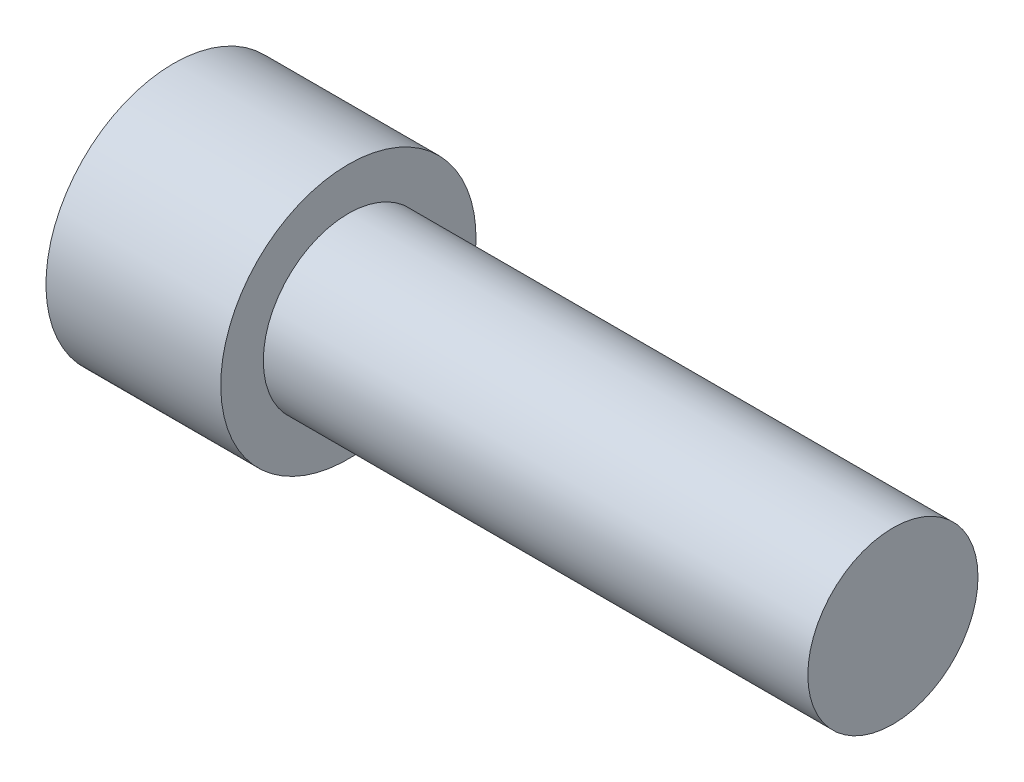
from build123d import *

# Parameters (mm, degrees)
CUT_EXTRUDE1_DEPTH = 3.81


with BuildPart() as part:
    # Sketch1 → Revolve1 (revolve)
    with BuildSketch(Plane.XY):
        Polygon((33.5534, 0), (0, 0), (0, 5.953125), (8.1534, 5.953125), (8.1534, 3.96875), (33.5534, 3.96875), align=None)
    revolve(axis=Axis((33.5534, 0, 0), (-1, 0, 0)))

    # Sketch2 → Cut-Extrude1 (cut)
    with BuildSketch(Plane.ZY):
        Polygon((3.666174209, 0), (1.833087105, 3.175), (-1.833087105, 3.175), (-3.666174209, 0), (-1.833087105, -3.175), (1.833087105, -3.175), align=None)
    extrude(amount=-CUT_EXTRUDE1_DEPTH, mode=Mode.SUBTRACT)


solid = part.part
